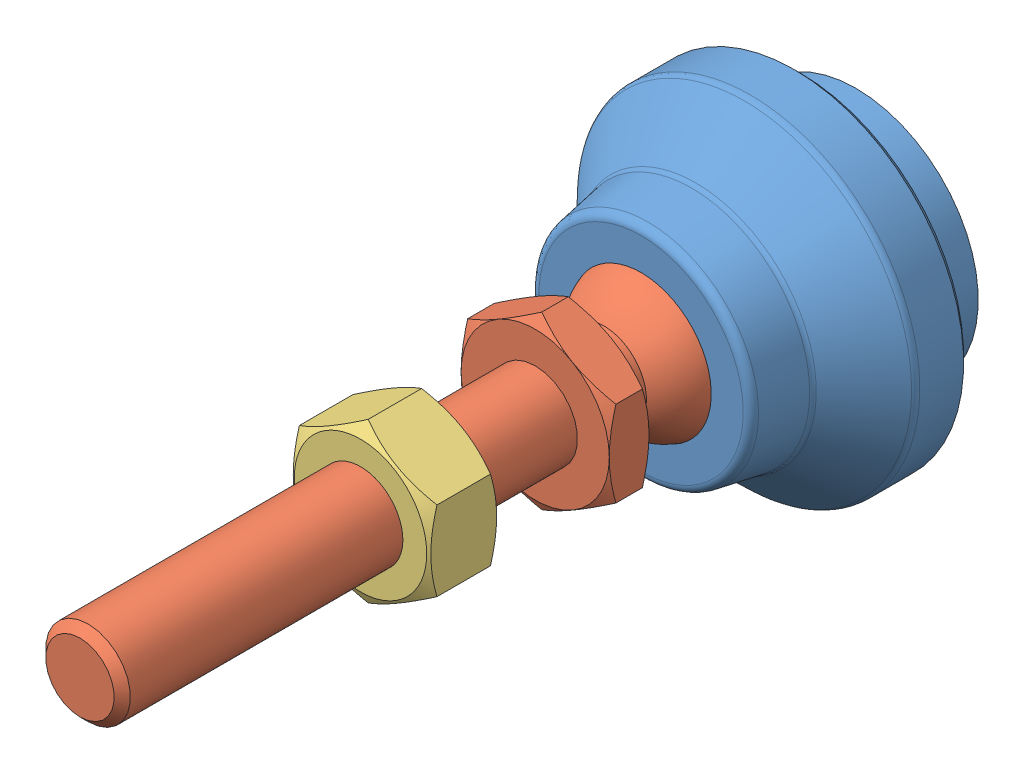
SolidWorks assembly LSVA32-M8X43.sldasm, configuration Default (file format 15000). Lengths in mm.
Overall size (32 32 73.3).
3 component instances, 3 part files, 0 mates.
Components (placement in the parent):
- LSVA32-M8X43_01-1: LSVA32-M8X43_01.sldprt [Default] at (0 0 5.3) x (1 0 0) z (0 -1 0) size (32 20.3 32)
- LSVA32-M8X43_02-1: LSVA32-M8X43_02.sldprt [Default] at (0 0 18.05) x (1 0 0) z (0 -1 0) size (14 62.25 16.17)
- LSVA32-M8X43_03-1: LSVA32-M8X43_03.sldprt [Default] at (0 0 40.3) size (13 15.01 6.5)
